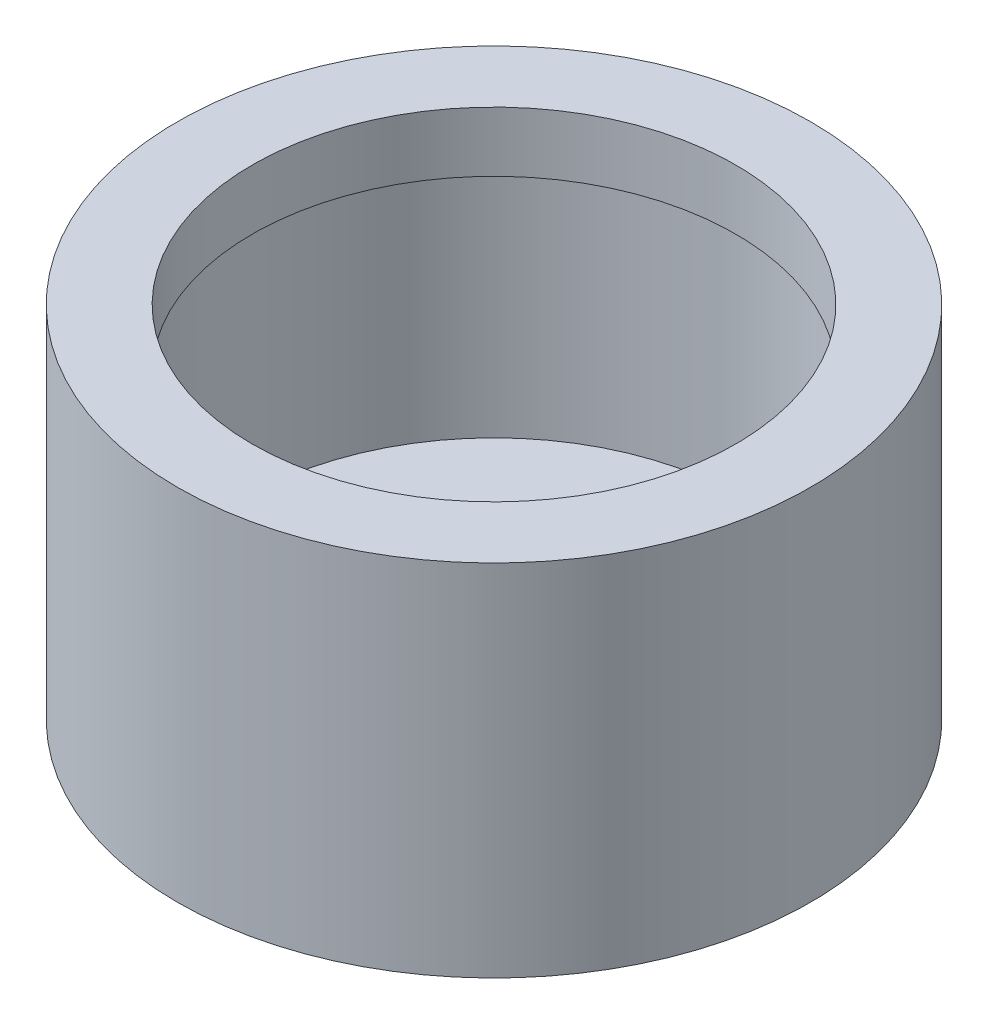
from build123d import *

# Parameters (mm, degrees)
F_4_40_TAPPED_HOLE1_D     = 2.2606
F_4_40_TAPPED_HOLE1_DEPTH = 5.08
F_4_40_TAPPED_HOLE1_TIP   = 0.679152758


with BuildPart() as part:
    # Sketch1 → Body (revolve)
    with BuildSketch(Plane.XY, mode=Mode.PRIVATE) as body_sk:
        Polygon((14.351, 0), (14.351, -3.556), (14.732, -3.556), (14.732, -17.272), (0, -17.272), (0, -21.336), (18.796, -21.336), (18.796, 0), align=None)
    revolve(body_sk.sketch.rotate(Axis((0, 0, 0), (0, -1, 0)), 90), axis=Axis((0, 0, 0), (0, -1, 0)))

    # 4-40 Tapped Hole1
    with Locations(Plane(origin=(-7.62, -21.336, 14.732), x_dir=(0, 0, -1), z_dir=(0, -1, 0))):
        with Locations((0, 0), (0, 15.24)):
            Hole(F_4_40_TAPPED_HOLE1_D / 2, depth=F_4_40_TAPPED_HOLE1_DEPTH)
            with Locations((0, 0, -(F_4_40_TAPPED_HOLE1_DEPTH + F_4_40_TAPPED_HOLE1_TIP / 2))):  # 118° drill point
                Cone(0, F_4_40_TAPPED_HOLE1_D / 2, F_4_40_TAPPED_HOLE1_TIP, mode=Mode.SUBTRACT)


solid = part.part
